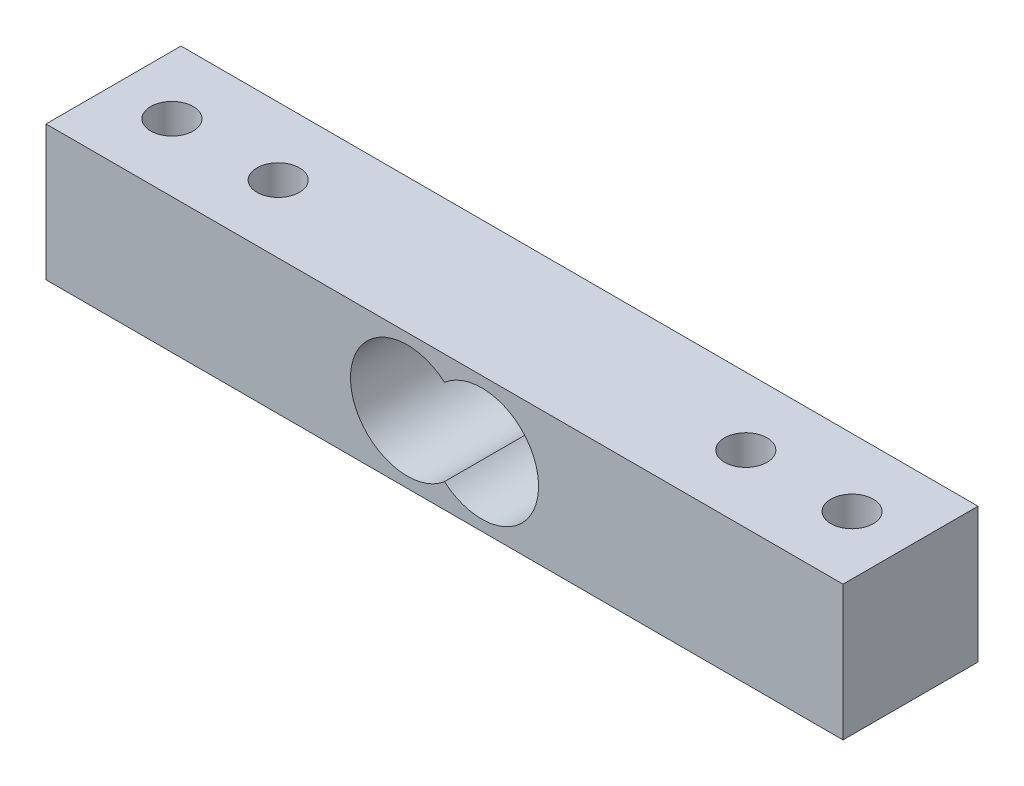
from build123d import *

# Parameters (mm, degrees)
SKETCH1_W           = 75
SKETCH1_H           = 12.7
SKETCH1_R           = 2
BOSS_EXTRUDE1_DEPTH = 12.7
CUT_EXTRUDE1_DEPTH  = 12.7


with BuildPart() as part:
    # Sketch1 → Boss-Extrude1 (new body)
    with BuildSketch(Plane(origin=(0, 0, 0), x_dir=(1, 0, 0), z_dir=(0, 1, 0))):
        Rectangle(SKETCH1_W, SKETCH1_H)
        with Locations(Location((-22, 0, 0), (0, 0, 270))):
            Circle(SKETCH1_R, mode=Mode.SUBTRACT)
        with Locations(Location((-32, 0, 0), (0, 0, 270))):
            Circle(SKETCH1_R, mode=Mode.SUBTRACT)
        with Locations(Location((22, 0, 0), (0, 0, 90))):
            Circle(SKETCH1_R, mode=Mode.SUBTRACT)
        with Locations(Location((32, 0, 0), (0, 0, 90))):
            Circle(SKETCH1_R, mode=Mode.SUBTRACT)
    extrude(amount=BOSS_EXTRUDE1_DEPTH)

    # Sketch2 → Cut-Extrude1 (cut)
    with BuildSketch(Plane.XY.offset(6.35)):
        with BuildLine():
            ThreePointArc((0, 10.396294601), (-8.85, 6.35), (0, 2.303705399))
            ThreePointArc((0, 2.303705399), (8.85, 6.35), (0, 10.396294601))
        make_face()
    extrude(amount=-CUT_EXTRUDE1_DEPTH, mode=Mode.SUBTRACT)


solid = part.part
